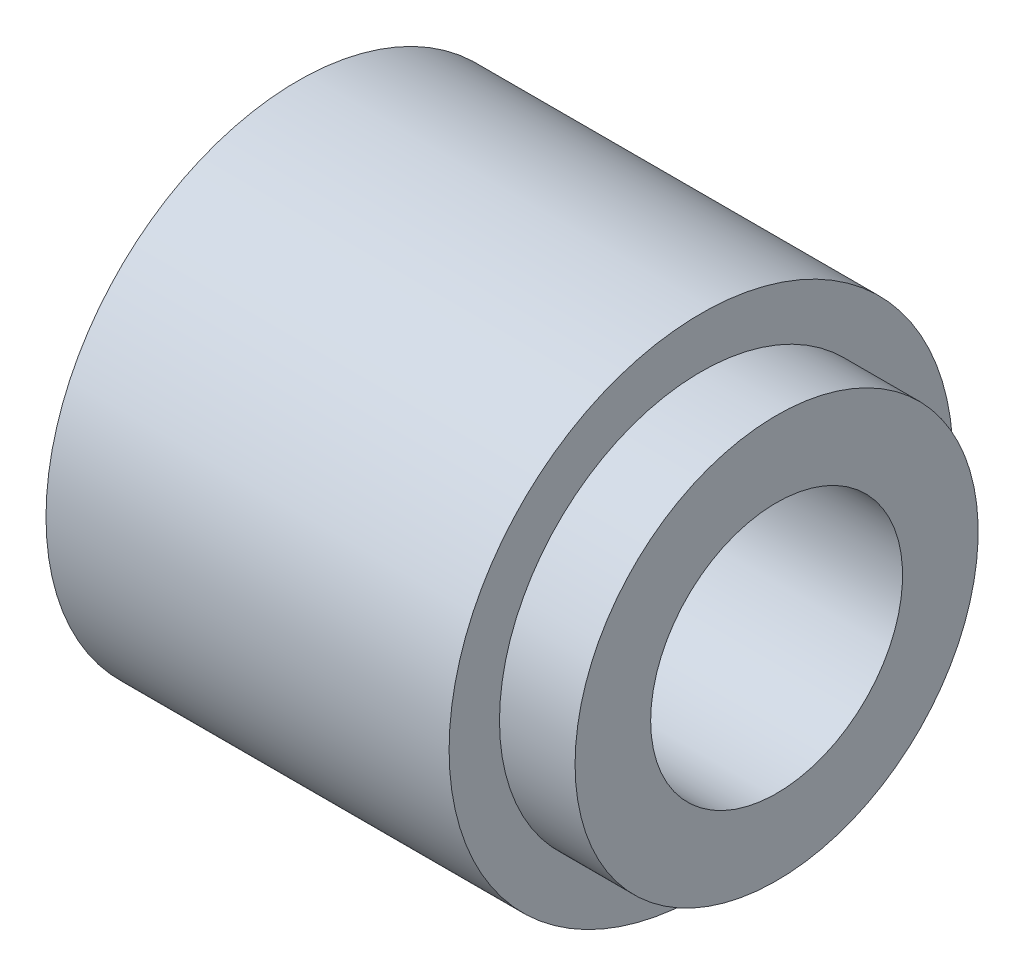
from build123d import *


with BuildPart() as part:
    # Sketch1 → Revolve1 (revolve)
    with BuildSketch(Plane.XY, mode=Mode.PRIVATE) as revolve1_sk:
        Polygon((0, 5), (0, 2.5), (9.5, 2.5), (9.5, 4), (8, 4), (8, 5), align=None)
    revolve(revolve1_sk.sketch.rotate(Axis((0, 0, 0), (1, 0, 0)), 90), axis=Axis((0, 0, 0), (1, 0, 0)))


solid = part.part
